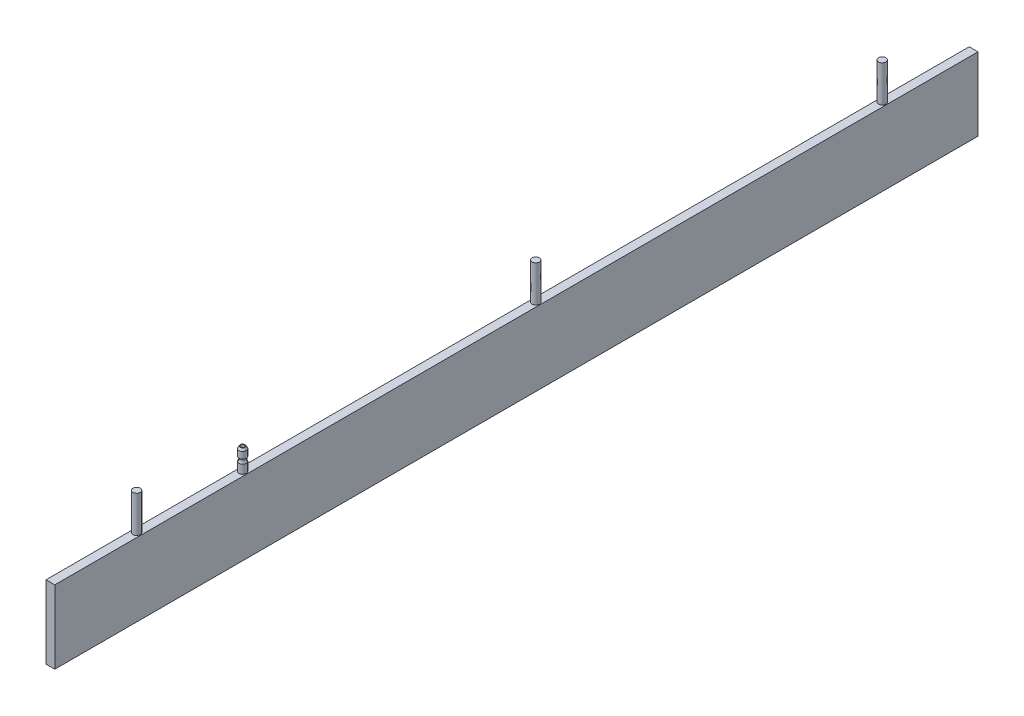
from build123d import *

# Parameters (mm, degrees)
ESQUISSE1_W      = 12
ESQUISSE1_H      = 100
EXTRUSION1_DEPTH = 1263
ESQUISSE2_R      = 5
EXTRUSION2_DEPTH = 50
ESQUISSE3_R      = 5
EXTRUSION3_DEPTH = 30
CHANFREIN1_SIZE  = 3
CHANFREIN1_SIZE2 = 1.732050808
ESQUISSE4_R      = 2.5
EXTRUSION4_DEPTH = 30
ESQUISSE5_R      = 5


with BuildPart() as part:
    # Esquisse1 → Extrusion1 (new body)
    with BuildSketch(Plane.XY):
        with Locations((0, 50)):
            Rectangle(ESQUISSE1_W, ESQUISSE1_H)
    extrude(amount=EXTRUSION1_DEPTH)

    # Esquisse2 → Extrusion2 (add)
    with BuildSketch(Plane(origin=(0, 100, 0), x_dir=(1, 0, 0), z_dir=(0, 1, 0))):
        with Locations(Location((0, -599, 0), (0, 0, 90))):
            Circle(ESQUISSE2_R)
        with Locations(Location((0, -125, 0), (0, 0, 90))):
            Circle(ESQUISSE2_R)
        with Locations(Location((0, -1145, 0), (0, 0, 90))):
            Circle(ESQUISSE2_R)
    extrude(amount=EXTRUSION2_DEPTH)

    # Esquisse3 → Extrusion3 (add)
    with BuildSketch(Plane(origin=(0, 100, 0), x_dir=(-1, 0, 0), z_dir=(0, 1, 0))):
        with Locations(Location((0, 1000, 0), (0, 0, 270))):
            Circle(ESQUISSE3_R)
    extrude(amount=EXTRUSION3_DEPTH)

    # Chanfrein1
    chanfrein1_edges = [part.edges().sort_by_distance(p)[0] for p in [
        (0, 130, 1005),
    ]]
    chanfrein1_side = [part.faces().sort_by_distance(p)[0] for p in [
        (0, 115, 1005),
    ]]
    chamfer(chanfrein1_edges, length=CHANFREIN1_SIZE, length2=CHANFREIN1_SIZE2, reference=chanfrein1_side[0])

    # Esquisse4 → Extrusion4 (cut)
    with BuildSketch(Plane(origin=(0, 130, 0), x_dir=(1, 0, 0), z_dir=(0, 1, 0))):
        with Locations(Location((0, -1000, 0), (0, 0, 270))):
            Circle(ESQUISSE4_R)
    extrude(amount=-EXTRUSION4_DEPTH, mode=Mode.SUBTRACT)

    # Esquisse5 → Enl_vement de mati_re-R_volution1 (revolve, cut)
    with BuildSketch(Plane(origin=(0, 0, 0), x_dir=(0, 0, -1), z_dir=(1, 0, 0)), mode=Mode.PRIVATE) as enl_vement_de_mati_re_r_volution1_sk:
        with Locations((-1009, 115)):
            Circle(ESQUISSE5_R)
    revolve(enl_vement_de_mati_re_r_volution1_sk.sketch.rotate(Axis((0, 127, 1000), (0, -1, 0)), 180), axis=Axis((0, 127, 1000), (0, -1, 0)), mode=Mode.SUBTRACT)


solid = part.part
